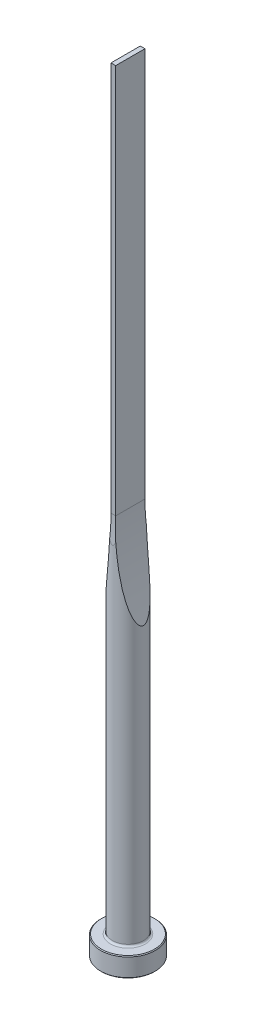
from build123d import *

# Parameters (mm, degrees)
CUT_EXTRUDE1_DEPTH = 5
CUT_EXTRUDE2_DEPTH = 5


with BuildPart() as part:
    # Sketch1 → Revolve1 (revolve)
    with BuildSketch(Plane.XY, mode=Mode.PRIVATE) as revolve1_sk:
        with BuildLine():
            Line((0, 0), (6.8, 0))
            Line((6.8, 0), (7, 0.2))
            Line((7, 0.2), (7, 4.8))
            Line((7, 4.8), (6.8, 5))
            Line((6.8, 5), (4.5, 5))
            ThreePointArc((4.5, 5), (4.146446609, 5.146446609), (4, 5.5))
            Line((4, 5.5), (4, 200))
            Line((4, 200), (0, 200))
            Line((0, 200), (0, 0))
        make_face()
    revolve(revolve1_sk.sketch.rotate(Axis((0, 200, 0), (0, -1, 0)), 180), axis=Axis((0, 200, 0), (0, -1, 0)))

    # Sketch2 → Cut-Extrude1 (cut, symmetric)
    with BuildSketch(Plane.XY):
        with BuildLine():
            Line((0.6, 200), (0.6, 100))
            ThreePointArc((0.6, 100), (1.454052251, 87.630683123), (4, 75.496122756))
            Line((4, 75.496122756), (4, 200))
            Line((4, 200), (0.6, 200))
        make_face()
        with BuildLine():
            Line((-0.6, 200), (-0.6, 100))
            ThreePointArc((-0.6, 100), (-1.454052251, 87.630683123), (-4, 75.496122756))
            Line((-4, 75.496122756), (-4, 200))
            Line((-4, 200), (-0.6, 200))
        make_face()
    extrude(amount=CUT_EXTRUDE1_DEPTH, both=True, mode=Mode.SUBTRACT)

    # Sketch3 → Cut-Extrude2 (cut, symmetric)
    with BuildSketch(Plane(origin=(0, 0, 0), x_dir=(0, 0, -1), z_dir=(1, 0, 0))):
        with BuildLine():
            Line((3.75, 200), (3.75, 100))
            ThreePointArc((3.75, 100), (3.812521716, 96.645898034), (4, 93.296456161))
            Line((4, 93.296456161), (4, 200))
            Line((4, 200), (3.75, 200))
        make_face()
        with BuildLine():
            Line((-3.75, 200), (-3.75, 100))
            ThreePointArc((-3.75, 100), (-3.812521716, 96.645898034), (-4, 93.296456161))
            Line((-4, 93.296456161), (-4, 200))
            Line((-4, 200), (-3.75, 200))
        make_face()
    extrude(amount=CUT_EXTRUDE2_DEPTH, both=True, mode=Mode.SUBTRACT)


solid = part.part
